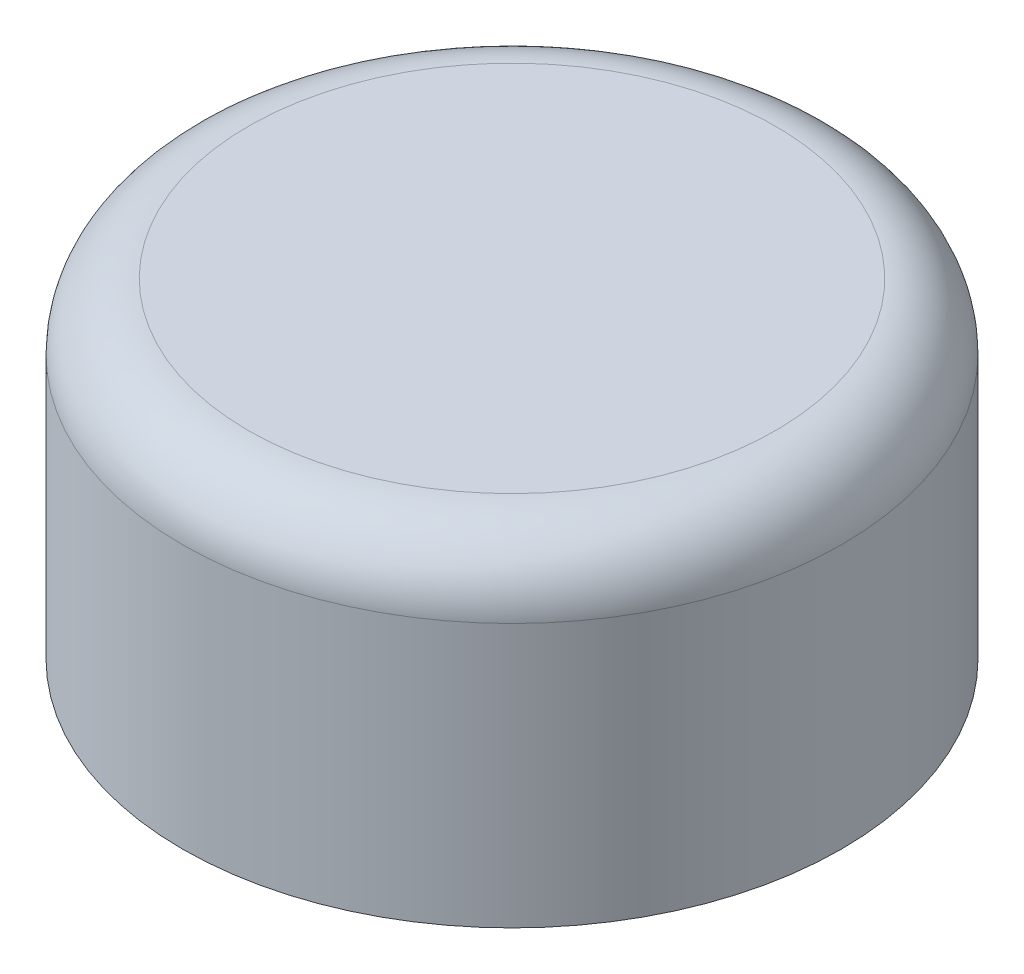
from build123d import *

# Parameters (mm, degrees)
SKETCH1_R           = 10
BOSS_EXTRUDE1_DEPTH = 10
FILLET1_R           = 2
SKETCH2_R           = 4
CUT_EXTRUDE1_DEPTH  = 5


with BuildPart() as part:
    # Sketch1 → Boss-Extrude1 (new body)
    with BuildSketch(Plane(origin=(0, 0, 0), x_dir=(1, 0, 0), z_dir=(0, 1, 0))):
        with Locations(Location((0, 0, 0), (0, 0, 270))):
            Circle(SKETCH1_R)
    extrude(amount=BOSS_EXTRUDE1_DEPTH)

    # Fillet1
    fillet1_edges = [part.edges().sort_by_distance(p)[0] for p in [
        (0, 10, -10),
    ]]
    fillet(fillet1_edges, radius=FILLET1_R)

    # Sketch2 → Cut-Extrude1 (cut)
    with BuildSketch(Plane.XZ):
        with Locations(Location((0, 0, 0), (0, 0, 270))):
            Circle(SKETCH2_R)
    extrude(amount=-CUT_EXTRUDE1_DEPTH, mode=Mode.SUBTRACT)


solid = part.part
